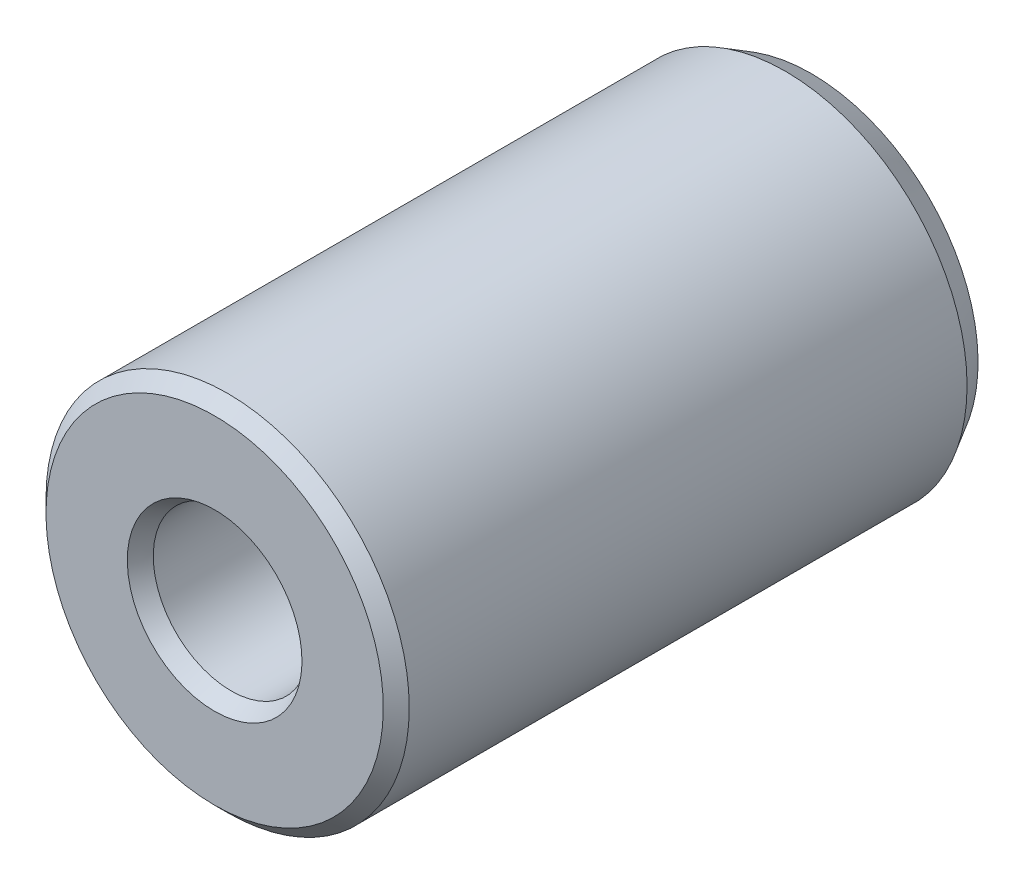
ISO-10303-21;
HEADER;
FILE_DESCRIPTION(('STEP AP214'),'2;1');
FILE_NAME('part.step','',(''),(''),'','','');
FILE_SCHEMA(('AUTOMOTIVE_DESIGN { 1 0 10303 214 1 1 1 1 }'));
ENDSEC;
DATA;
#1=APPLICATION_CONTEXT('core data for automotive mechanical design processes');
#2=APPLICATION_PROTOCOL_DEFINITION('international standard','automotive_design',2000,#1);
#3=PRODUCT_CONTEXT('',#1,'mechanical');
#4=PRODUCT('Part','Part','',(#3));
#5=PRODUCT_RELATED_PRODUCT_CATEGORY('part','',(#4));
#6=PRODUCT_DEFINITION_FORMATION('','',#4);
#7=PRODUCT_DEFINITION_CONTEXT('part definition',#1,'design');
#8=PRODUCT_DEFINITION('design','',#6,#7);
#9=PRODUCT_DEFINITION_SHAPE('','',#8);
#10=(LENGTH_UNIT() NAMED_UNIT(*) SI_UNIT(.MILLI.,.METRE.));
#11=(NAMED_UNIT(*) PLANE_ANGLE_UNIT() SI_UNIT($,.RADIAN.));
#12=(NAMED_UNIT(*) SI_UNIT($,.STERADIAN.) SOLID_ANGLE_UNIT());
#13=UNCERTAINTY_MEASURE_WITH_UNIT(LENGTH_MEASURE(1.E-05),#10,'distance_accuracy_value','');
#14=(GEOMETRIC_REPRESENTATION_CONTEXT(3) GLOBAL_UNCERTAINTY_ASSIGNED_CONTEXT((#13)) GLOBAL_UNIT_ASSIGNED_CONTEXT((#10,
#11,#12)) REPRESENTATION_CONTEXT('',''));
#15=CARTESIAN_POINT('',(0.,0.,0.));
#16=DIRECTION('',(0.,0.,1.));
#17=DIRECTION('',(1.,0.,0.));
#18=AXIS2_PLACEMENT_3D('',#15,#16,#17);
#19=CARTESIAN_POINT('',(0.,0.,23.));
#20=DIRECTION('',(0.,0.,1.));
#21=DIRECTION('',(0.,-1.,0.));
#22=AXIS2_PLACEMENT_3D('',#19,#20,#21);
#23=CYLINDRICAL_SURFACE('',#22,2.5);
#24=CARTESIAN_POINT('',(0.,0.,1.));
#25=DIRECTION('',(0.,0.,-1.));
#26=DIRECTION('',(0.,1.,0.));
#27=AXIS2_PLACEMENT_3D('',#24,#25,#26);
#28=CIRCLE('',#27,2.5);
#29=CARTESIAN_POINT('',(0.,2.5,1.));
#30=VERTEX_POINT('',#29);
#31=EDGE_CURVE('E48',#30,#30,#28,.T.);
#32=ORIENTED_EDGE('',*,*,#31,.T.);
#33=EDGE_LOOP('',(#32));
#34=FACE_BOUND('',#33,.T.);
#35=CARTESIAN_POINT('',(0.,0.,11.));
#36=DIRECTION('',(0.,0.,1.));
#37=DIRECTION('',(1.,0.,0.));
#38=AXIS2_PLACEMENT_3D('',#35,#36,#37);
#39=CIRCLE('',#38,2.5);
#40=CARTESIAN_POINT('',(2.5,0.,11.));
#41=VERTEX_POINT('',#40);
#42=EDGE_CURVE('E16',#41,#41,#39,.F.);
#43=ORIENTED_EDGE('',*,*,#42,.F.);
#44=EDGE_LOOP('',(#43));
#45=FACE_BOUND('',#44,.T.);
#46=ADVANCED_FACE('F12',(#34,#45),#23,.F.);
#47=CARTESIAN_POINT('',(0.,0.,23.));
#48=DIRECTION('',(0.,0.,-1.));
#49=DIRECTION('',(0.,1.,0.));
#50=AXIS2_PLACEMENT_3D('',#47,#48,#49);
#51=CYLINDRICAL_SURFACE('',#50,7.);
#52=CARTESIAN_POINT('',(0.,0.,22.5));
#53=DIRECTION('',(0.,0.,1.));
#54=DIRECTION('',(0.,-1.,0.));
#55=AXIS2_PLACEMENT_3D('',#52,#53,#54);
#56=CIRCLE('',#55,7.);
#57=CARTESIAN_POINT('',(0.,-7.,22.5));
#58=VERTEX_POINT('',#57);
#59=EDGE_CURVE('E20',#58,#58,#56,.F.);
#60=ORIENTED_EDGE('',*,*,#59,.T.);
#61=EDGE_LOOP('',(#60));
#62=FACE_BOUND('',#61,.T.);
#63=CARTESIAN_POINT('',(0.,0.,1.));
#64=DIRECTION('',(0.,0.,-1.));
#65=DIRECTION('',(0.,1.,0.));
#66=AXIS2_PLACEMENT_3D('',#63,#64,#65);
#67=CIRCLE('',#66,7.);
#68=CARTESIAN_POINT('',(0.,7.,1.));
#69=VERTEX_POINT('',#68);
#70=EDGE_CURVE('E45',#69,#69,#67,.F.);
#71=ORIENTED_EDGE('',*,*,#70,.T.);
#72=EDGE_LOOP('',(#71));
#73=FACE_BOUND('',#72,.T.);
#74=ADVANCED_FACE('F71',(#62,#73),#51,.T.);
#75=CARTESIAN_POINT('',(7.,0.,23.));
#76=DIRECTION('',(0.,0.,1.));
#77=DIRECTION('',(0.,-1.,0.));
#78=AXIS2_PLACEMENT_3D('',#75,#76,#77);
#79=PLANE('',#78);
#80=CARTESIAN_POINT('',(0.,0.,23.));
#81=DIRECTION('',(0.,0.,1.));
#82=DIRECTION('',(0.,-1.,0.));
#83=AXIS2_PLACEMENT_3D('',#80,#81,#82);
#84=CIRCLE('',#83,6.5);
#85=CARTESIAN_POINT('',(0.,-6.5,23.));
#86=VERTEX_POINT('',#85);
#87=EDGE_CURVE('E8',#86,#86,#84,.T.);
#88=ORIENTED_EDGE('',*,*,#87,.T.);
#89=EDGE_LOOP('',(#88));
#90=FACE_BOUND('',#89,.T.);
#91=CARTESIAN_POINT('',(0.,0.,23.));
#92=DIRECTION('',(0.,0.,1.));
#93=DIRECTION('',(0.,-1.,0.));
#94=AXIS2_PLACEMENT_3D('',#91,#92,#93);
#95=CIRCLE('',#94,3.36602540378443);
#96=CARTESIAN_POINT('',(0.,-3.36602540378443,23.));
#97=VERTEX_POINT('',#96);
#98=EDGE_CURVE('E25',#97,#97,#95,.F.);
#99=ORIENTED_EDGE('',*,*,#98,.T.);
#100=EDGE_LOOP('',(#99));
#101=FACE_BOUND('',#100,.T.);
#102=ADVANCED_FACE('F53',(#90,#101),#79,.T.);
#103=CARTESIAN_POINT('',(0.,0.,0.));
#104=DIRECTION('',(0.,0.,-1.));
#105=DIRECTION('',(0.,1.,0.));
#106=AXIS2_PLACEMENT_3D('',#103,#104,#105);
#107=PLANE('',#106);
#108=CARTESIAN_POINT('',(0.,0.,0.));
#109=DIRECTION('',(0.,0.,-1.));
#110=DIRECTION('',(0.,1.,0.));
#111=AXIS2_PLACEMENT_3D('',#108,#109,#110);
#112=CIRCLE('',#111,6.42264973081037);
#113=CARTESIAN_POINT('',(0.,6.42264973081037,0.));
#114=VERTEX_POINT('',#113);
#115=EDGE_CURVE('E42',#114,#114,#112,.T.);
#116=ORIENTED_EDGE('',*,*,#115,.T.);
#117=EDGE_LOOP('',(#116));
#118=FACE_BOUND('',#117,.T.);
#119=CARTESIAN_POINT('',(0.,0.,0.));
#120=DIRECTION('',(0.,0.,-1.));
#121=DIRECTION('',(0.,1.,0.));
#122=AXIS2_PLACEMENT_3D('',#119,#120,#121);
#123=CIRCLE('',#122,3.07735026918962);
#124=CARTESIAN_POINT('',(0.,3.07735026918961,0.));
#125=VERTEX_POINT('',#124);
#126=EDGE_CURVE('E34',#125,#125,#123,.F.);
#127=ORIENTED_EDGE('',*,*,#126,.T.);
#128=EDGE_LOOP('',(#127));
#129=FACE_BOUND('',#128,.T.);
#130=ADVANCED_FACE('F85',(#118,#129),#107,.T.);
#131=CARTESIAN_POINT('',(0.,0.,0.));
#132=DIRECTION('',(0.,0.,1.));
#133=DIRECTION('',(0.,-1.,0.));
#134=AXIS2_PLACEMENT_3D('',#131,#132,#133);
#135=CONICAL_SURFACE('',#134,6.42264973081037,0.523598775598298);
#136=ORIENTED_EDGE('',*,*,#70,.F.);
#137=EDGE_LOOP('',(#136));
#138=FACE_BOUND('',#137,.T.);
#139=ORIENTED_EDGE('',*,*,#115,.F.);
#140=EDGE_LOOP('',(#139));
#141=FACE_BOUND('',#140,.T.);
#142=ADVANCED_FACE('F67',(#138,#141),#135,.T.);
#143=CARTESIAN_POINT('',(0.,0.,1.));
#144=DIRECTION('',(0.,0.,-1.));
#145=DIRECTION('',(0.,1.,0.));
#146=AXIS2_PLACEMENT_3D('',#143,#144,#145);
#147=CONICAL_SURFACE('',#146,2.5,0.523598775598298);
#148=ORIENTED_EDGE('',*,*,#126,.F.);
#149=EDGE_LOOP('',(#148));
#150=FACE_BOUND('',#149,.T.);
#151=ORIENTED_EDGE('',*,*,#31,.F.);
#152=EDGE_LOOP('',(#151));
#153=FACE_BOUND('',#152,.T.);
#154=ADVANCED_FACE('F57',(#150,#153),#147,.F.);
#155=CARTESIAN_POINT('',(0.,0.,21.5));
#156=DIRECTION('',(0.,0.,1.));
#157=DIRECTION('',(0.,-1.,0.));
#158=AXIS2_PLACEMENT_3D('',#155,#156,#157);
#159=CONICAL_SURFACE('',#158,2.5,0.523598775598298);
#160=CARTESIAN_POINT('',(0.,0.,22.3660254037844));
#161=DIRECTION('',(0.,0.,1.));
#162=DIRECTION('',(0.,-1.,0.));
#163=AXIS2_PLACEMENT_3D('',#160,#161,#162);
#164=CIRCLE('',#163,3.);
#165=CARTESIAN_POINT('',(0.,-3.,22.3660254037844));
#166=VERTEX_POINT('',#165);
#167=EDGE_CURVE('E28',#166,#166,#164,.T.);
#168=ORIENTED_EDGE('',*,*,#167,.F.);
#169=EDGE_LOOP('',(#168));
#170=FACE_BOUND('',#169,.T.);
#171=ORIENTED_EDGE('',*,*,#98,.F.);
#172=EDGE_LOOP('',(#171));
#173=FACE_BOUND('',#172,.T.);
#174=ADVANCED_FACE('F55',(#170,#173),#159,.F.);
#175=CARTESIAN_POINT('',(0.,0.,22.5));
#176=DIRECTION('',(0.,0.,-1.));
#177=DIRECTION('',(0.,1.,0.));
#178=AXIS2_PLACEMENT_3D('',#175,#176,#177);
#179=CONICAL_SURFACE('',#178,7.,0.78539816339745);
#180=ORIENTED_EDGE('',*,*,#87,.F.);
#181=EDGE_LOOP('',(#180));
#182=FACE_BOUND('',#181,.T.);
#183=ORIENTED_EDGE('',*,*,#59,.F.);
#184=EDGE_LOOP('',(#183));
#185=FACE_BOUND('',#184,.T.);
#186=ADVANCED_FACE('F14',(#182,#185),#179,.T.);
#187=CARTESIAN_POINT('',(0.,0.,11.));
#188=DIRECTION('',(0.,0.,1.));
#189=DIRECTION('',(1.,0.,0.));
#190=AXIS2_PLACEMENT_3D('',#187,#188,#189);
#191=PLANE('',#190);
#192=CARTESIAN_POINT('',(0.,0.,11.));
#193=DIRECTION('',(0.,0.,1.));
#194=DIRECTION('',(1.,0.,0.));
#195=AXIS2_PLACEMENT_3D('',#192,#193,#194);
#196=CIRCLE('',#195,3.);
#197=CARTESIAN_POINT('',(3.,0.,11.));
#198=VERTEX_POINT('',#197);
#199=EDGE_CURVE('E30',#198,#198,#196,.T.);
#200=ORIENTED_EDGE('',*,*,#199,.T.);
#201=EDGE_LOOP('',(#200));
#202=FACE_BOUND('',#201,.T.);
#203=ORIENTED_EDGE('',*,*,#42,.T.);
#204=EDGE_LOOP('',(#203));
#205=FACE_BOUND('',#204,.T.);
#206=ADVANCED_FACE('F65',(#202,#205),#191,.T.);
#207=CARTESIAN_POINT('',(0.,0.,11.));
#208=DIRECTION('',(0.,0.,1.));
#209=DIRECTION('',(1.,0.,0.));
#210=AXIS2_PLACEMENT_3D('',#207,#208,#209);
#211=CYLINDRICAL_SURFACE('',#210,3.);
#212=ORIENTED_EDGE('',*,*,#167,.T.);
#213=EDGE_LOOP('',(#212));
#214=FACE_BOUND('',#213,.T.);
#215=ORIENTED_EDGE('',*,*,#199,.F.);
#216=EDGE_LOOP('',(#215));
#217=FACE_BOUND('',#216,.T.);
#218=ADVANCED_FACE('F83',(#214,#217),#211,.F.);
#219=CLOSED_SHELL('',(#46,#74,#102,#130,#142,#154,#174,#186,#206,#218));
#220=MANIFOLD_SOLID_BREP('B1',#219);
#221=ADVANCED_BREP_SHAPE_REPRESENTATION('',(#18,#220),#14);
#222=SHAPE_DEFINITION_REPRESENTATION(#9,#221);
ENDSEC;
END-ISO-10303-21;
